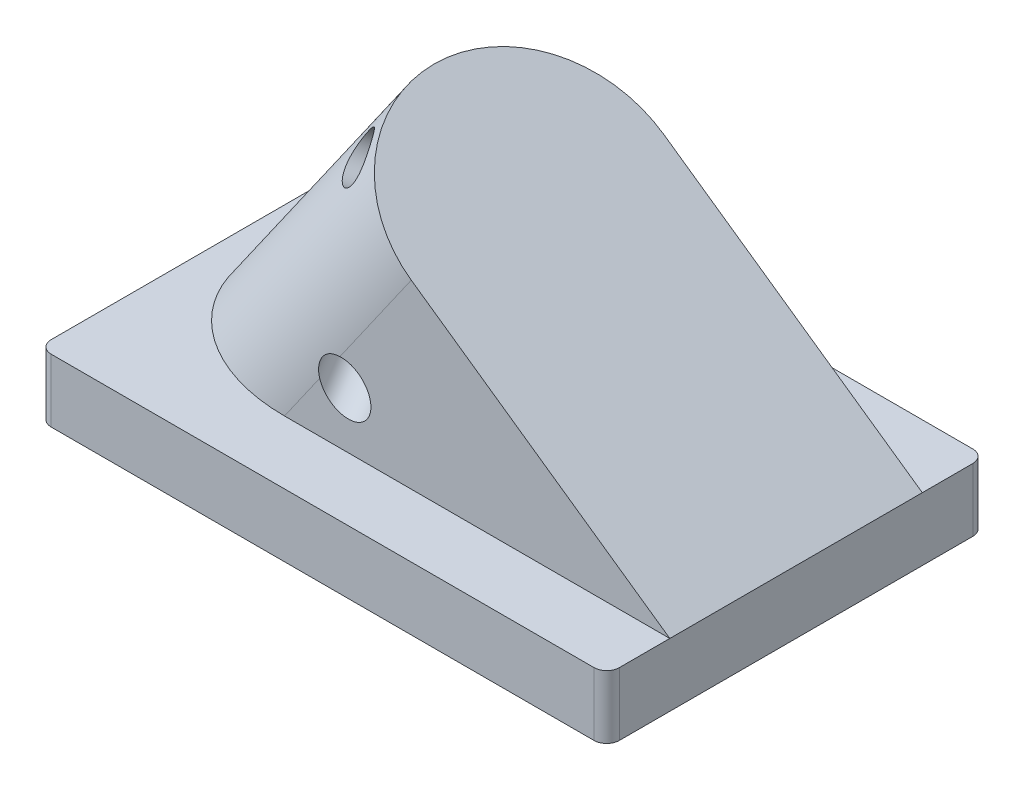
from build123d import *

# Parameters (mm, degrees)
SKETCH1_W                    = 114.3
SKETCH1_H                    = 76.2
BOSS_EXTRUDE1_DEPTH          = 12.7
BOSS_EXTRUDE2_REACH          = 99.024
SKETCH14_R                   = 4.7625
CUT_EXTRUDE2_DEPTH           = 12.7
F_3_8_0_375_DIAMETER_HOLE2_D = 9.525
CUT_EXTRUDE1_DEPTH           = 133.230139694
F_3_8_0_375_DIAMETER_HOLE3_D = 9.525
FILLET1_R                    = 2.54


with BuildPart() as part:
    # Sketch1 → Boss-Extrude1 (new body)
    with BuildSketch(Plane(origin=(0, 0, 0), x_dir=(1, 0, 0), z_dir=(0, 1, 0))):
        Rectangle(SKETCH1_W, SKETCH1_H)
    extrude(amount=BOSS_EXTRUDE1_DEPTH)

    # Boss-Extrude2: up to this face of the body (flat: up to its plane)
    boss_extrude2_end = Plane(part.part.faces().sort_by_distance((0, 12.7, 0))[0])
    # Sketch2 → Boss-Extrude2 (add, up to the picked face)
    with BuildSketch(Plane(origin=(24.768822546, 35.373544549, 0), x_dir=(0, 0, -1), z_dir=(0.5735764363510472, 0.819152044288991, 0)), mode=Mode.PRIVATE) as boss_extrude2_sk1:
        with BuildLine():
            Line((-25.4, 23.969881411), (-25.4, -39.530118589))
            Line((-25.4, -39.530118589), (25.4, -39.530118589))
            Line((25.4, -39.530118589), (25.4, 23.969881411))
            ThreePointArc((25.4, 23.969881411), (0, 49.369881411), (-25.4, 23.969881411))
        make_face()
    boss_extrude2_tool1 = split(extrude(boss_extrude2_sk1.sketch, amount=-BOSS_EXTRUDE2_REACH, mode=Mode.PRIVATE), bisect_by=boss_extrude2_end, keep=Keep.BOTH, mode=Mode.PRIVATE)
    add(boss_extrude2_tool1.solids().sort_by(Axis((22.8135, 36.742676, 0), (-0.5735764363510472, -0.819152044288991, 0)))[0])

    # Sketch14 → Cut-Extrude2 (cut)
    with BuildSketch(Plane(origin=(-40.441439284, 28.317400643, 0), x_dir=(0, 0, 1), z_dir=(-0.819152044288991, 0.5735764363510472, 0))):
        with Locations(Location((0, -1.2668757, 0), (0, 0, 270))):
            Circle(SKETCH14_R)
    extrude(amount=-CUT_EXTRUDE2_DEPTH, mode=Mode.SUBTRACT)

    # 3_8 _0.375_ Diameter Hole2 (through all)
    with Locations(Plane(origin=(-24.529878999, 17.176006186, 29.945452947), x_dir=(0.5735764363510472, 0.819152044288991, 0), z_dir=(-0.5792279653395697, 0.40557978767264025, 0.7071067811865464))):
        with Locations((35.2329243, 21.213753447)):
            Hole(F_3_8_0_375_DIAMETER_HOLE2_D / 2)

    # Sketch8 → Cut-Extrude1 (cut, through all)
    with BuildSketch(Plane(origin=(-57.598544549, 10.156177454, 0), x_dir=(0, 0, 1), z_dir=(-0.984807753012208, 0.1736481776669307, 0))):
        with BuildLine():
            Line((-32.076277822, -9.923993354), (32.076277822, -9.923993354))
            ThreePointArc((32.076277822, -9.923993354), (0, -1.22693489), (-32.076277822, -9.923993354))
        make_face()
    extrude(amount=-CUT_EXTRUDE1_DEPTH, mode=Mode.SUBTRACT)

    # 3_8 _0.375_ Diameter Hole3 (through all)
    with Locations(Plane(origin=(-15.311975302, 10.721560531, -32.37630837), x_dir=(0.5735764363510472, 0.819152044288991, 0), z_dir=(-0.40957602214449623, 0.2867882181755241, -0.8660254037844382))):
        with Locations((14.6081243, -30.283526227)):
            Hole(F_3_8_0_375_DIAMETER_HOLE3_D / 2)

    # Fillet1
    fillet1_edges = [part.edges().sort_by_distance(p)[0] for p in [
        (57.15, 6.35, 38.1),
        (-57.15, 6.35, 38.1),
        (-57.15, 6.35, -38.1),
        (57.15, 6.35, -38.1),
    ]]
    fillet(fillet1_edges, radius=FILLET1_R)


solid = part.part
